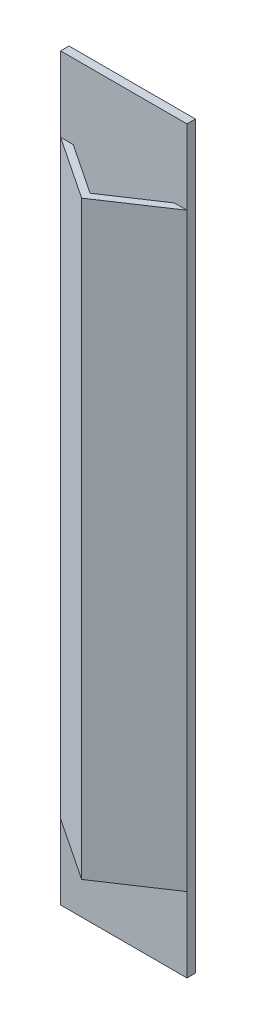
from build123d import *

# Parameters (mm, degrees)
SKETCH1_W        = 3.81
SKETCH1_H        = 22.2885
ARM_DEPTH        = 0.254
CORD_COVER_DEPTH = 8.89


with BuildPart() as part:
    # Sketch1 → Arm (new body)
    with BuildSketch(Plane.XY):
        Rectangle(SKETCH1_W, SKETCH1_H)
    extrude(amount=-ARM_DEPTH)

    # Sketch2 → Cord Cover (add, symmetric)
    with BuildSketch(Plane(origin=(0, 0, 0), x_dir=(1, 0, 0), z_dir=(0, 1, 0))):
        Polygon((-1.905, 0), (0, -1.27), (1.905, 0), (1.905, 0.254), (0, -1.016), (-1.905, 0.254), align=None)
    extrude(amount=CORD_COVER_DEPTH, both=True)


solid = part.part
